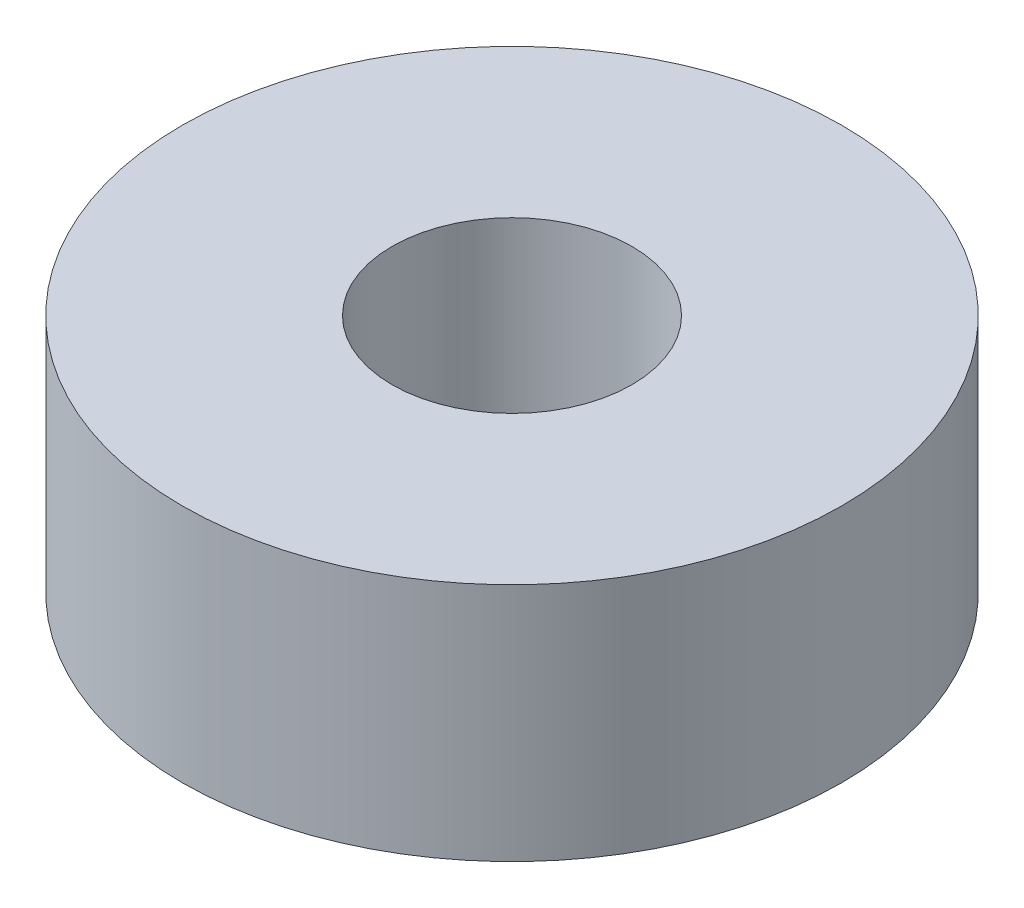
ISO-10303-21;
HEADER;
FILE_DESCRIPTION(('STEP AP214'),'2;1');
FILE_NAME('part.step','',(''),(''),'','','');
FILE_SCHEMA(('AUTOMOTIVE_DESIGN { 1 0 10303 214 1 1 1 1 }'));
ENDSEC;
DATA;
#1=APPLICATION_CONTEXT('core data for automotive mechanical design processes');
#2=APPLICATION_PROTOCOL_DEFINITION('international standard','automotive_design',2000,#1);
#3=PRODUCT_CONTEXT('',#1,'mechanical');
#4=PRODUCT('Part','Part','',(#3));
#5=PRODUCT_RELATED_PRODUCT_CATEGORY('part','',(#4));
#6=PRODUCT_DEFINITION_FORMATION('','',#4);
#7=PRODUCT_DEFINITION_CONTEXT('part definition',#1,'design');
#8=PRODUCT_DEFINITION('design','',#6,#7);
#9=PRODUCT_DEFINITION_SHAPE('','',#8);
#10=(LENGTH_UNIT() NAMED_UNIT(*) SI_UNIT(.MILLI.,.METRE.));
#11=(NAMED_UNIT(*) PLANE_ANGLE_UNIT() SI_UNIT($,.RADIAN.));
#12=(NAMED_UNIT(*) SI_UNIT($,.STERADIAN.) SOLID_ANGLE_UNIT());
#13=UNCERTAINTY_MEASURE_WITH_UNIT(LENGTH_MEASURE(1.E-05),#10,'distance_accuracy_value','');
#14=(GEOMETRIC_REPRESENTATION_CONTEXT(3) GLOBAL_UNCERTAINTY_ASSIGNED_CONTEXT((#13)) GLOBAL_UNIT_ASSIGNED_CONTEXT((#10,
#11,#12)) REPRESENTATION_CONTEXT('',''));
#15=CARTESIAN_POINT('',(0.,0.,0.));
#16=DIRECTION('',(0.,0.,1.));
#17=DIRECTION('',(1.,0.,0.));
#18=AXIS2_PLACEMENT_3D('',#15,#16,#17);
#19=CARTESIAN_POINT('',(0.,8.,0.));
#20=DIRECTION('',(0.,-1.,0.));
#21=DIRECTION('',(0.,0.,-1.));
#22=AXIS2_PLACEMENT_3D('',#19,#20,#21);
#23=CYLINDRICAL_SURFACE('',#22,11.);
#24=CARTESIAN_POINT('',(0.,8.,0.));
#25=DIRECTION('',(0.,1.,0.));
#26=DIRECTION('',(0.,0.,1.));
#27=AXIS2_PLACEMENT_3D('',#24,#25,#26);
#28=CIRCLE('',#27,11.);
#29=CARTESIAN_POINT('',(0.,8.,11.));
#30=VERTEX_POINT('',#29);
#31=EDGE_CURVE('E10',#30,#30,#28,.T.);
#32=ORIENTED_EDGE('',*,*,#31,.F.);
#33=EDGE_LOOP('',(#32));
#34=FACE_BOUND('',#33,.T.);
#35=CARTESIAN_POINT('',(0.,0.,0.));
#36=DIRECTION('',(0.,1.,0.));
#37=DIRECTION('',(0.,0.,1.));
#38=AXIS2_PLACEMENT_3D('',#35,#36,#37);
#39=CIRCLE('',#38,11.);
#40=CARTESIAN_POINT('',(0.,0.,11.));
#41=VERTEX_POINT('',#40);
#42=EDGE_CURVE('E40',#41,#41,#39,.T.);
#43=ORIENTED_EDGE('',*,*,#42,.T.);
#44=EDGE_LOOP('',(#43));
#45=FACE_BOUND('',#44,.T.);
#46=ADVANCED_FACE('F37',(#34,#45),#23,.T.);
#47=CARTESIAN_POINT('',(0.,8.,0.));
#48=DIRECTION('',(0.,1.,0.));
#49=DIRECTION('',(0.,0.,1.));
#50=AXIS2_PLACEMENT_3D('',#47,#48,#49);
#51=PLANE('',#50);
#52=CARTESIAN_POINT('',(0.,8.,0.));
#53=DIRECTION('',(0.,1.,0.));
#54=DIRECTION('',(0.,0.,1.));
#55=AXIS2_PLACEMENT_3D('',#52,#53,#54);
#56=CIRCLE('',#55,4.);
#57=CARTESIAN_POINT('',(0.,8.,4.));
#58=VERTEX_POINT('',#57);
#59=EDGE_CURVE('E51',#58,#58,#56,.T.);
#60=ORIENTED_EDGE('',*,*,#59,.F.);
#61=EDGE_LOOP('',(#60));
#62=FACE_BOUND('',#61,.T.);
#63=ORIENTED_EDGE('',*,*,#31,.T.);
#64=EDGE_LOOP('',(#63));
#65=FACE_BOUND('',#64,.T.);
#66=ADVANCED_FACE('F68',(#62,#65),#51,.T.);
#67=CARTESIAN_POINT('',(0.,0.,0.));
#68=DIRECTION('',(0.,1.,0.));
#69=DIRECTION('',(0.,0.,1.));
#70=AXIS2_PLACEMENT_3D('',#67,#68,#69);
#71=PLANE('',#70);
#72=CARTESIAN_POINT('',(0.,0.,0.));
#73=DIRECTION('',(0.,1.,0.));
#74=DIRECTION('',(0.,0.,1.));
#75=AXIS2_PLACEMENT_3D('',#72,#73,#74);
#76=CIRCLE('',#75,4.);
#77=CARTESIAN_POINT('',(0.,0.,4.));
#78=VERTEX_POINT('',#77);
#79=EDGE_CURVE('E49',#78,#78,#76,.T.);
#80=ORIENTED_EDGE('',*,*,#79,.T.);
#81=EDGE_LOOP('',(#80));
#82=FACE_BOUND('',#81,.T.);
#83=ORIENTED_EDGE('',*,*,#42,.F.);
#84=EDGE_LOOP('',(#83));
#85=FACE_BOUND('',#84,.T.);
#86=ADVANCED_FACE('F59',(#82,#85),#71,.F.);
#87=CARTESIAN_POINT('',(0.,0.,0.));
#88=DIRECTION('',(0.,1.,0.));
#89=DIRECTION('',(0.,0.,1.));
#90=AXIS2_PLACEMENT_3D('',#87,#88,#89);
#91=CYLINDRICAL_SURFACE('',#90,4.);
#92=ORIENTED_EDGE('',*,*,#79,.F.);
#93=EDGE_LOOP('',(#92));
#94=FACE_BOUND('',#93,.T.);
#95=ORIENTED_EDGE('',*,*,#59,.T.);
#96=EDGE_LOOP('',(#95));
#97=FACE_BOUND('',#96,.T.);
#98=ADVANCED_FACE('F62',(#94,#97),#91,.F.);
#99=CLOSED_SHELL('',(#46,#66,#86,#98));
#100=MANIFOLD_SOLID_BREP('B2',#99);
#101=ADVANCED_BREP_SHAPE_REPRESENTATION('',(#18,#100),#14);
#102=SHAPE_DEFINITION_REPRESENTATION(#9,#101);
ENDSEC;
END-ISO-10303-21;
